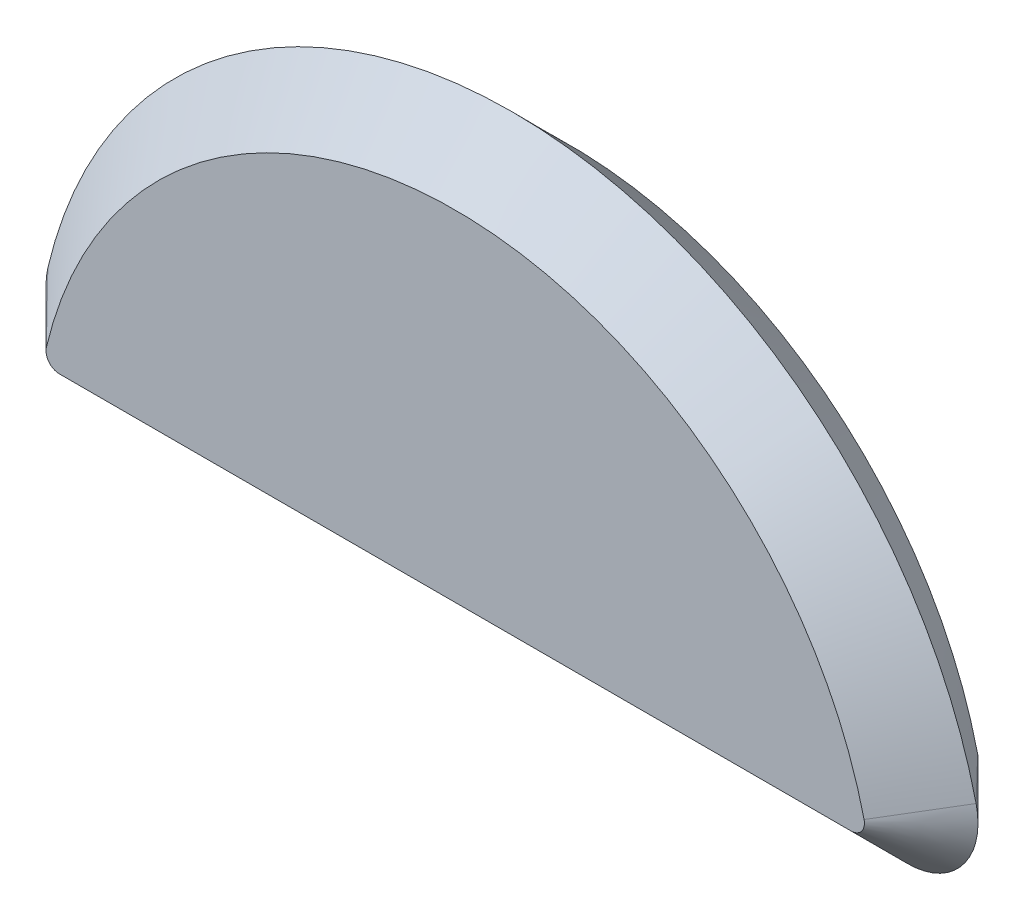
from build123d import *

# Parameters (mm, degrees)
EXTRUDE1_DEPTH = 21.552615


with BuildPart() as part:
    # Sweep2: sweep along a path in Sketch1
    with BuildLine(Plane.XY) as sweep2_path:
        Line((-75.141082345, 15.24), (75.141082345, 15.24))
        ThreePointArc((75.141082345, 15.24), (77.133212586, 16.204240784), (77.612828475, 18.364868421))
        ThreePointArc((77.612828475, 18.364868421), (0, 79.756), (-77.612828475, 18.364868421))
        ThreePointArc((-77.612828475, 18.364868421), (-77.133212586, 16.204240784), (-75.141082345, 15.24))
    # Sketch2 → Sweep2 (sweep)
    with BuildSketch(Plane(origin=(0, 0, 0), x_dir=(0, 0, -1), z_dir=(1, 0, 0))):
        Polygon((0, 15.24), (10.776307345, 4.463692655), (21.552614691, 15.24), align=None)
    sweep(path=sweep2_path.line)

    # Sketch1_2 → Extrude1 (add, through all)
    with BuildSketch(Plane.XY):
        with BuildLine():
            Line((-75.141082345, 15.24), (75.141082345, 15.24))
            ThreePointArc((75.141082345, 15.24), (77.133212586, 16.204240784), (77.612828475, 18.364868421))
            ThreePointArc((77.612828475, 18.364868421), (0, 79.756), (-77.612828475, 18.364868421))
            ThreePointArc((-77.612828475, 18.364868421), (-77.133212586, 16.204240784), (-75.141082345, 15.24))
        make_face()
    extrude(amount=-EXTRUDE1_DEPTH)


solid = part.part
